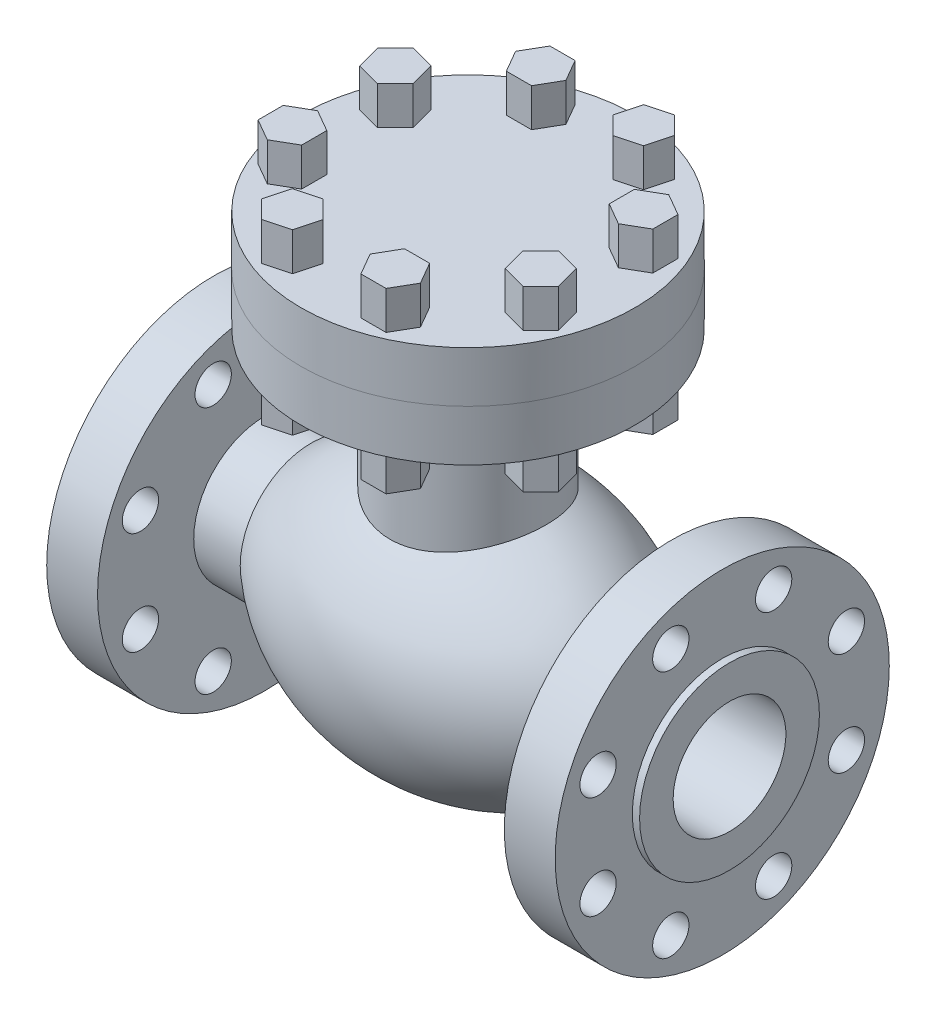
from build123d import *

# Parameters (mm, degrees)
FLOW_FLANGE_SKETCH_R          = 146.05
FLOW_FLANGE_DEPTH             = 50.8
HUB_CUT_SKETCH_OUTSIDE_W      = 417.336
HUB_CUT_SKETCH_OUTSIDE_H      = 417.336
HUB_CUT_SKETCH_OUTSIDE_R      = 78.613
HUB_CUT_DEPTH                 = 6.35
BOLT_HOLE_REACH               = 503.69
BOLT_HOLE_SKETCH_R            = 15.875
BOLT_HOLE_PATTERN_COUNT       = 8
BOLT_HOLE_PATTERN_ANGLE       = 315
FLANGE_MIRROR_COPY_1_REACH    = 503.69
FLANGE_MIRROR_COPY_1_SKETCH_R = 15.875
FLANGE_MIRROR_COPY_2_REACH    = 503.69
FLANGE_MIRROR_COPY_2_SKETCH_R = 15.875
FLANGE_MIRROR_COPY_3_REACH    = 503.69
FLANGE_MIRROR_COPY_3_SKETCH_R = 15.875
FLANGE_MIRROR_COPY_4_REACH    = 503.69
FLANGE_MIRROR_COPY_4_SKETCH_R = 15.875
FLANGE_MIRROR_COPY_5_REACH    = 503.69
FLANGE_MIRROR_COPY_5_SKETCH_R = 15.875
FLANGE_MIRROR_COPY_6_REACH    = 503.69
FLANGE_MIRROR_COPY_6_SKETCH_R = 15.875
FLANGE_MIRROR_COPY_7_REACH    = 503.69
FLANGE_MIRROR_COPY_7_SKETCH_R = 15.875
BODY_EXTRUDE_SKETCH_R         = 68.1736
BODY_EXTRUDE_DEPTH            = 306.07
FLANGE_BOTTOM_SKETCH_R        = 146.05
FLANGE_BOTTOM_DEPTH           = 44.45
FLANGE_TOP_SKETCH_R           = 146.05
FLANGE_TOP_DEPTH              = 44.45
ID_SKETCH_R                   = 49.276
ID_CUT_DEPTH                  = 570.246244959
BOLT_DEPTH                    = 155.575
BOLT_PATTERN_COUNT            = 8
BOLT_PATTERN_ANGLE            = 315


with BuildPart() as part:
    # Flow Extrude Sketch → Flow Extrude (revolve)
    with BuildSketch(Plane.XY, mode=Mode.PRIVATE) as flow_extrude_sk:
        with BuildLine():
            Line((137.16, 61.976), (228.6, 61.976))
            Line((228.6, 61.976), (228.6, 0))
            Line((228.6, 0), (-228.6, 0))
            Line((-228.6, 0), (-228.6, 61.976))
            Line((-228.6, 61.976), (-137.16, 61.976))
            ThreePointArc((-137.16, 61.976), (0, 114.3), (137.16, 61.976))
        make_face()
    revolve(flow_extrude_sk.sketch.rotate(Axis((-245.321131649, 0, 0), (1, 0, 0)), 90), axis=Axis((-245.321131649, 0, 0), (1, 0, 0)))

    # Flow Flange Sketch → Flow Flange (add)
    with BuildSketch(Plane(origin=(228.6, 0, 0), x_dir=(0, 0, -1), z_dir=(1, 0, 0))):
        Circle(FLOW_FLANGE_SKETCH_R)
    flow_flange = extrude(amount=-FLOW_FLANGE_DEPTH)

    # Hub Cut Sketch outside → Hub Cut (cut)
    with BuildSketch(Plane(origin=(228.6, 0, 0), x_dir=(0, 0, -1), z_dir=(1, 0, 0))):
        Rectangle(HUB_CUT_SKETCH_OUTSIDE_W, HUB_CUT_SKETCH_OUTSIDE_H)
        Circle(HUB_CUT_SKETCH_OUTSIDE_R, mode=Mode.SUBTRACT)
    hub_cut = extrude(amount=-HUB_CUT_DEPTH, mode=Mode.SUBTRACT)

    # Bolt Hole Sketch → Bolt Hole (cut, up to next)
    with BuildSketch(Plane(origin=(228.6, 0, 0), x_dir=(0, 0, -1), z_dir=(1, 0, 0)), mode=Mode.PRIVATE) as bolt_hole_sk1:
        with Locations((44.955736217, 108.532748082)):
            Circle(BOLT_HOLE_SKETCH_R)
    bolt_hole_tool1 = extrude(bolt_hole_sk1.sketch, amount=-BOLT_HOLE_REACH, mode=Mode.PRIVATE) & part.part
    bolt_hole = bolt_hole_tool1.solids().sort_by_distance((228.6, 108.532748, -44.955736))[0]
    add(bolt_hole, mode=Mode.SUBTRACT)

    # Bolt Hole Pattern: Bolt Hole ×8 about axis
    bolt_hole_pattern_axis = Axis((-245.321131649, 0, 0), (1, 0, 0))
    for i in range(1, BOLT_HOLE_PATTERN_COUNT):
        add(bolt_hole.rotate(bolt_hole_pattern_axis, i * BOLT_HOLE_PATTERN_ANGLE / (BOLT_HOLE_PATTERN_COUNT - 1)), mode=Mode.SUBTRACT)

    # Flange Mirror: Flow Flange, Hub Cut, Bolt Hole across plane
    add(flow_flange.mirror(Plane(origin=(0, 0, 0), x_dir=(0, 0, 1), z_dir=(1, 0, 0))))
    add(hub_cut.mirror(Plane(origin=(0, 0, 0), x_dir=(0, 0, 1), z_dir=(1, 0, 0))), mode=Mode.SUBTRACT)
    add(bolt_hole.mirror(Plane(origin=(0, 0, 0), x_dir=(0, 0, 1), z_dir=(1, 0, 0))), mode=Mode.SUBTRACT)

    # Flange Mirror copy 1 sketch → Flange Mirror copy 1 (cut, up to next)
    with BuildSketch(Plane(origin=(-228.6, 0, 0), x_dir=(0, 0.7071067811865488, -0.7071067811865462), z_dir=(-1, 0, 0)), mode=Mode.PRIVATE) as flange_mirror_copy_1_sk1:
        with Locations((44.955736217, -108.532748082)):
            Circle(FLANGE_MIRROR_COPY_1_SKETCH_R)
    flange_mirror_copy_1_tool1 = extrude(flange_mirror_copy_1_sk1.sketch, amount=-FLANGE_MIRROR_COPY_1_REACH, mode=Mode.PRIVATE) & part.part
    add(flange_mirror_copy_1_tool1.solids().sort_by_distance((-228.6, 108.53274787, 44.955736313))[0], mode=Mode.SUBTRACT)

    # Flange Mirror copy 2 sketch → Flange Mirror copy 2 (cut, up to next)
    with BuildSketch(Plane(origin=(-228.6, 0, 0), x_dir=(0, 1, 0), z_dir=(-1, 0, 0)), mode=Mode.PRIVATE) as flange_mirror_copy_2_sk1:
        with Locations((44.955736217, -108.532748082)):
            Circle(FLANGE_MIRROR_COPY_2_SKETCH_R)
    flange_mirror_copy_2_tool1 = extrude(flange_mirror_copy_2_sk1.sketch, amount=-FLANGE_MIRROR_COPY_2_REACH, mode=Mode.PRIVATE) & part.part
    add(flange_mirror_copy_2_tool1.solids().sort_by_distance((-228.6, 44.955736, 108.532748))[0], mode=Mode.SUBTRACT)

    # Flange Mirror copy 3 sketch → Flange Mirror copy 3 (cut, up to next)
    with BuildSketch(Plane(origin=(-228.6, 0, 0), x_dir=(0, 0.7071067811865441, 0.7071067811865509), z_dir=(-1, 0, 0)), mode=Mode.PRIVATE) as flange_mirror_copy_3_sk1:
        with Locations((44.955736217, -108.532748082)):
            Circle(FLANGE_MIRROR_COPY_3_SKETCH_R)
    flange_mirror_copy_3_tool1 = extrude(flange_mirror_copy_3_sk1.sketch, amount=-FLANGE_MIRROR_COPY_3_REACH, mode=Mode.PRIVATE) & part.part
    add(flange_mirror_copy_3_tool1.solids().sort_by_distance((-228.6, -44.955736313, 108.53274787))[0], mode=Mode.SUBTRACT)

    # Flange Mirror copy 4 sketch → Flange Mirror copy 4 (cut, up to next)
    with BuildSketch(Plane.ZY.offset(228.6), mode=Mode.PRIVATE) as flange_mirror_copy_4_sk1:
        with Locations((44.955736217, -108.532748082)):
            Circle(FLANGE_MIRROR_COPY_4_SKETCH_R)
    flange_mirror_copy_4_tool1 = extrude(flange_mirror_copy_4_sk1.sketch, amount=-FLANGE_MIRROR_COPY_4_REACH, mode=Mode.PRIVATE) & part.part
    add(flange_mirror_copy_4_tool1.solids().sort_by_distance((-228.6, -108.532748, 44.955736))[0], mode=Mode.SUBTRACT)

    # Flange Mirror copy 5 sketch → Flange Mirror copy 5 (cut, up to next)
    with BuildSketch(Plane(origin=(-228.6, 0, 0), x_dir=(0, -0.7071067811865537, 0.7071067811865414), z_dir=(-1, 0, 0)), mode=Mode.PRIVATE) as flange_mirror_copy_5_sk1:
        with Locations((44.955736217, -108.532748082)):
            Circle(FLANGE_MIRROR_COPY_5_SKETCH_R)
    flange_mirror_copy_5_tool1 = extrude(flange_mirror_copy_5_sk1.sketch, amount=-FLANGE_MIRROR_COPY_5_REACH, mode=Mode.PRIVATE) & part.part
    add(flange_mirror_copy_5_tool1.solids().sort_by_distance((-228.6, -108.53274787, -44.955736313))[0], mode=Mode.SUBTRACT)

    # Flange Mirror copy 6 sketch → Flange Mirror copy 6 (cut, up to next)
    with BuildSketch(Plane(origin=(-228.6, 0, 0), x_dir=(0, -1, 0), z_dir=(-1, 0, 0)), mode=Mode.PRIVATE) as flange_mirror_copy_6_sk1:
        with Locations((44.955736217, -108.532748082)):
            Circle(FLANGE_MIRROR_COPY_6_SKETCH_R)
    flange_mirror_copy_6_tool1 = extrude(flange_mirror_copy_6_sk1.sketch, amount=-FLANGE_MIRROR_COPY_6_REACH, mode=Mode.PRIVATE) & part.part
    add(flange_mirror_copy_6_tool1.solids().sort_by_distance((-228.6, -44.955736, -108.532748))[0], mode=Mode.SUBTRACT)

    # Flange Mirror copy 7 sketch → Flange Mirror copy 7 (cut, up to next)
    with BuildSketch(Plane(origin=(-228.6, 0, 0), x_dir=(0, -0.7071067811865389, -0.7071067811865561), z_dir=(-1, 0, 0)), mode=Mode.PRIVATE) as flange_mirror_copy_7_sk1:
        with Locations((44.955736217, -108.532748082)):
            Circle(FLANGE_MIRROR_COPY_7_SKETCH_R)
    flange_mirror_copy_7_tool1 = extrude(flange_mirror_copy_7_sk1.sketch, amount=-FLANGE_MIRROR_COPY_7_REACH, mode=Mode.PRIVATE) & part.part
    add(flange_mirror_copy_7_tool1.solids().sort_by_distance((-228.6, 44.955736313, -108.53274787))[0], mode=Mode.SUBTRACT)

    # Body Extrude Sketch → Body Extrude (add)
    with BuildSketch(Plane(origin=(0, 0, 0), x_dir=(1, 0, 0), z_dir=(0, 1, 0))):
        with Locations(Location((0, 0, 0), (0, 0, 129.526455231))):
            Circle(BODY_EXTRUDE_SKETCH_R)
    extrude(amount=BODY_EXTRUDE_DEPTH)

    # Flange Bottom Sketch → Flange Bottom (add)
    with BuildSketch(Plane(origin=(0, 306.07, 0), x_dir=(-1, 0, 0), z_dir=(0, 1, 0))):
        with Locations(Location((0, 0, 0), (0, 0, 90))):
            Circle(FLANGE_BOTTOM_SKETCH_R)
    extrude(amount=-FLANGE_BOTTOM_DEPTH)

    # Flange Top Sketch → Flange Top (add)
    with BuildSketch(Plane.XZ.offset(-261.62)):
        with Locations(Location((0, 0, 0), (0, 0, 90))):
            Circle(FLANGE_TOP_SKETCH_R)
    extrude(amount=FLANGE_TOP_DEPTH)

    # ID Sketch → ID Cut (cut, through all)
    with BuildSketch(Plane.ZY.offset(-228.6)):
        Circle(ID_SKETCH_R)
    extrude(amount=ID_CUT_DEPTH, mode=Mode.SUBTRACT)

    # Bolt Sketch → Bolt (add)
    with BuildSketch(Plane(origin=(0, 339.4075, 0), x_dir=(-1, 0, 0), z_dir=(0, 1, 0))):
        Polygon((-108.532748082, -22.958690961), (-127.582748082, -33.957213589), (-127.582748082, -55.954258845), (-108.532748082, -66.952781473), (-89.482748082, -55.954258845), (-89.482748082, -33.957213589), align=None)
    bolt = extrude(amount=-BOLT_DEPTH)

    # Bolt Pattern: Bolt ×8 about axis
    bolt_pattern_axis = Axis((0, 261.62, 0), (0, 1, 0))
    for i in range(1, BOLT_PATTERN_COUNT):
        add(bolt.rotate(bolt_pattern_axis, i * BOLT_PATTERN_ANGLE / (BOLT_PATTERN_COUNT - 1)))


solid = part.part
